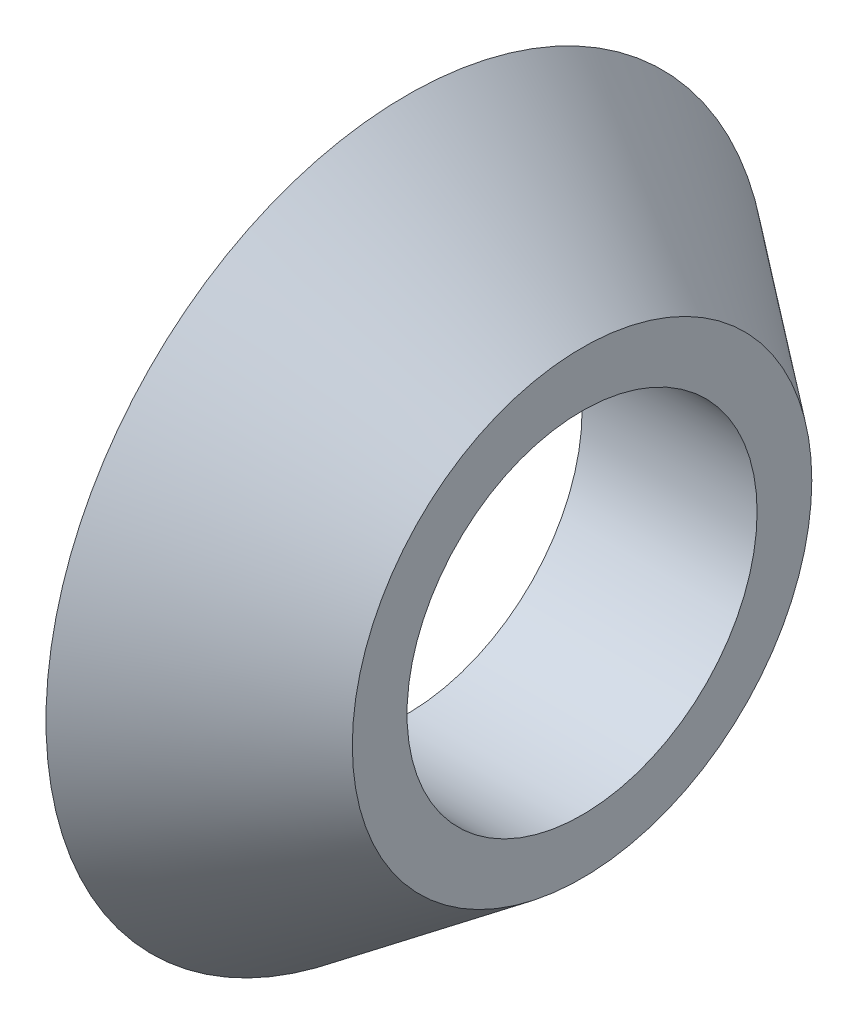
ISO-10303-21;
HEADER;
FILE_DESCRIPTION(('STEP AP214'),'2;1');
FILE_NAME('part.step','',(''),(''),'','','');
FILE_SCHEMA(('AUTOMOTIVE_DESIGN { 1 0 10303 214 1 1 1 1 }'));
ENDSEC;
DATA;
#1=APPLICATION_CONTEXT('core data for automotive mechanical design processes');
#2=APPLICATION_PROTOCOL_DEFINITION('international standard','automotive_design',2000,#1);
#3=PRODUCT_CONTEXT('',#1,'mechanical');
#4=PRODUCT('Part','Part','',(#3));
#5=PRODUCT_RELATED_PRODUCT_CATEGORY('part','',(#4));
#6=PRODUCT_DEFINITION_FORMATION('','',#4);
#7=PRODUCT_DEFINITION_CONTEXT('part definition',#1,'design');
#8=PRODUCT_DEFINITION('design','',#6,#7);
#9=PRODUCT_DEFINITION_SHAPE('','',#8);
#10=(LENGTH_UNIT() NAMED_UNIT(*) SI_UNIT(.MILLI.,.METRE.));
#11=(NAMED_UNIT(*) PLANE_ANGLE_UNIT() SI_UNIT($,.RADIAN.));
#12=(NAMED_UNIT(*) SI_UNIT($,.STERADIAN.) SOLID_ANGLE_UNIT());
#13=UNCERTAINTY_MEASURE_WITH_UNIT(LENGTH_MEASURE(1.E-05),#10,'distance_accuracy_value','');
#14=(GEOMETRIC_REPRESENTATION_CONTEXT(3) GLOBAL_UNCERTAINTY_ASSIGNED_CONTEXT((#13)) GLOBAL_UNIT_ASSIGNED_CONTEXT((#10,
#11,#12)) REPRESENTATION_CONTEXT('',''));
#15=CARTESIAN_POINT('',(0.,0.,0.));
#16=DIRECTION('',(0.,0.,1.));
#17=DIRECTION('',(1.,0.,0.));
#18=AXIS2_PLACEMENT_3D('',#15,#16,#17);
#19=CARTESIAN_POINT('',(-5.5,2.,0.));
#20=DIRECTION('',(-1.,0.,0.));
#21=DIRECTION('',(0.,0.,1.));
#22=AXIS2_PLACEMENT_3D('',#19,#20,#21);
#23=PLANE('',#22);
#24=CARTESIAN_POINT('',(-5.5,0.,0.));
#25=DIRECTION('',(1.,0.,0.));
#26=DIRECTION('',(0.,0.,-1.));
#27=AXIS2_PLACEMENT_3D('',#24,#25,#26);
#28=CIRCLE('',#27,2.);
#29=CARTESIAN_POINT('',(-5.5,0.,-2.));
#30=VERTEX_POINT('',#29);
#31=EDGE_CURVE('E10',#30,#30,#28,.T.);
#32=ORIENTED_EDGE('',*,*,#31,.T.);
#33=EDGE_LOOP('',(#32));
#34=FACE_BOUND('',#33,.T.);
#35=CARTESIAN_POINT('',(-5.5,0.,0.));
#36=DIRECTION('',(1.,0.,0.));
#37=DIRECTION('',(0.,0.,-1.));
#38=AXIS2_PLACEMENT_3D('',#35,#36,#37);
#39=CIRCLE('',#38,4.125);
#40=CARTESIAN_POINT('',(-5.5,0.,-4.125));
#41=VERTEX_POINT('',#40);
#42=EDGE_CURVE('E47',#41,#41,#39,.T.);
#43=ORIENTED_EDGE('',*,*,#42,.F.);
#44=EDGE_LOOP('',(#43));
#45=FACE_BOUND('',#44,.T.);
#46=ADVANCED_FACE('F33',(#34,#45),#23,.T.);
#47=CARTESIAN_POINT('',(17.609243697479,0.,0.));
#48=DIRECTION('',(1.,0.,0.));
#49=DIRECTION('',(0.,0.,-1.));
#50=AXIS2_PLACEMENT_3D('',#47,#48,#49);
#51=CYLINDRICAL_SURFACE('',#50,2.);
#52=CARTESIAN_POINT('',(-3.5,0.,0.));
#53=DIRECTION('',(1.,0.,0.));
#54=DIRECTION('',(0.,0.,-1.));
#55=AXIS2_PLACEMENT_3D('',#52,#53,#54);
#56=CIRCLE('',#55,2.);
#57=CARTESIAN_POINT('',(-3.5,0.,-2.));
#58=VERTEX_POINT('',#57);
#59=EDGE_CURVE('E39',#58,#58,#56,.T.);
#60=ORIENTED_EDGE('',*,*,#59,.T.);
#61=EDGE_LOOP('',(#60));
#62=FACE_BOUND('',#61,.T.);
#63=ORIENTED_EDGE('',*,*,#31,.F.);
#64=EDGE_LOOP('',(#63));
#65=FACE_BOUND('',#64,.T.);
#66=ADVANCED_FACE('F57',(#62,#65),#51,.F.);
#67=CARTESIAN_POINT('',(-3.5,2.625,0.));
#68=DIRECTION('',(1.,0.,0.));
#69=DIRECTION('',(0.,0.,-1.));
#70=AXIS2_PLACEMENT_3D('',#67,#68,#69);
#71=PLANE('',#70);
#72=CARTESIAN_POINT('',(-3.5,0.,0.));
#73=DIRECTION('',(1.,0.,0.));
#74=DIRECTION('',(0.,0.,-1.));
#75=AXIS2_PLACEMENT_3D('',#72,#73,#74);
#76=CIRCLE('',#75,2.625);
#77=CARTESIAN_POINT('',(-3.5,0.,-2.625));
#78=VERTEX_POINT('',#77);
#79=EDGE_CURVE('E43',#78,#78,#76,.T.);
#80=ORIENTED_EDGE('',*,*,#79,.T.);
#81=EDGE_LOOP('',(#80));
#82=FACE_BOUND('',#81,.T.);
#83=ORIENTED_EDGE('',*,*,#59,.F.);
#84=EDGE_LOOP('',(#83));
#85=FACE_BOUND('',#84,.T.);
#86=ADVANCED_FACE('F61',(#82,#85),#71,.T.);
#87=CARTESIAN_POINT('',(-3.5,0.,0.));
#88=DIRECTION('',(-1.,0.,0.));
#89=DIRECTION('',(0.,0.,1.));
#90=AXIS2_PLACEMENT_3D('',#87,#88,#89);
#91=CONICAL_SURFACE('',#90,2.625,0.643501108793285);
#92=ORIENTED_EDGE('',*,*,#42,.T.);
#93=EDGE_LOOP('',(#92));
#94=FACE_BOUND('',#93,.T.);
#95=ORIENTED_EDGE('',*,*,#79,.F.);
#96=EDGE_LOOP('',(#95));
#97=FACE_BOUND('',#96,.T.);
#98=ADVANCED_FACE('F53',(#94,#97),#91,.T.);
#99=CLOSED_SHELL('',(#46,#66,#86,#98));
#100=MANIFOLD_SOLID_BREP('B2',#99);
#101=ADVANCED_BREP_SHAPE_REPRESENTATION('',(#18,#100),#14);
#102=SHAPE_DEFINITION_REPRESENTATION(#9,#101);
ENDSEC;
END-ISO-10303-21;
